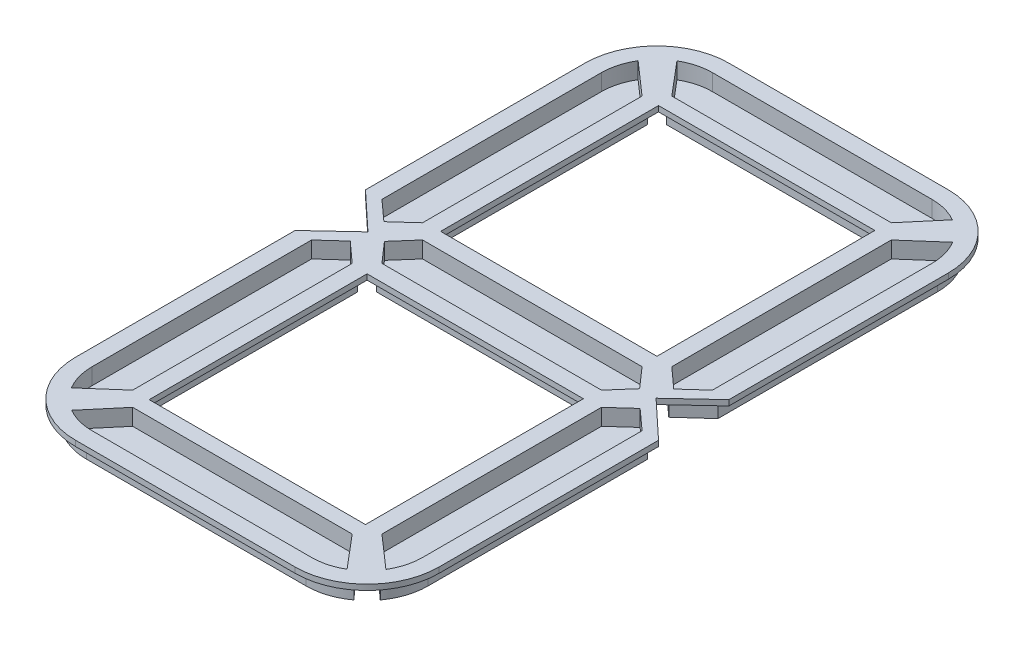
from build123d import *

# Parameters (mm, degrees)
SALIENTE_EXTRUIR1_DEPTH   = 4
SALIENTE_EXTRUIR2_DEPTH   = 1
CORTAR_EXTRUIR2_DEPTH     = 4
SALIENTE_EXTRUIR4_DEPTH   = 1
SALIENTE_EXTRUIR6_DEPTH   = 3
SALIENTE_EXTRUIR6_2_DEPTH = 3
SALIENTE_EXTRUIR6_3_DEPTH = 3
SALIENTE_EXTRUIR6_4_DEPTH = 3
SALIENTE_EXTRUIR6_5_DEPTH = 3
SALIENTE_EXTRUIR6_6_DEPTH = 3
CORTAR_EXTRUIR3_DEPTH     = 2
SALIENTE_EXTRUIR8_DEPTH   = 1


with BuildPart() as part:
    # Croquis1 → Saliente-Extruir1 (new body)
    with BuildSketch(Plane(origin=(0, 0, 0), x_dir=(1, 0, 0), z_dir=(0, 1, 0))):
        Polygon((20, -4.7), (-20, -4.7), (-24.25, 0), (-20, 4.7), (20, 4.7), (24.25, 0), align=None)
    extrude(amount=SALIENTE_EXTRUIR1_DEPTH)

    # Croquis2 → Saliente-Extruir2 (add)
    with BuildSketch(Plane(origin=(0, 4, 0), x_dir=(1, 0, 0), z_dir=(0, 1, 0))):
        Polygon((-20, 6.7), (20, 6.7), (26.25, 0), (20, -6.7), (-20, -6.7), (-26.25, 0), align=None)
    extrude(amount=-SALIENTE_EXTRUIR2_DEPTH)

    # Croquis3 → Cortar-Extruir2 (cut)
    with BuildSketch(Plane(origin=(0, 0, 0), x_dir=(-1, 0, 0), z_dir=(0, -1, 0))):
        Polygon((23.25, 0), (20, -3.7), (-20, -3.7), (-23.25, 0), (-20, 3.7), (20, 3.7), align=None)
    extrude(amount=-CORTAR_EXTRUIR2_DEPTH, mode=Mode.SUBTRACT)

    # Croquis4 → Saliente-Extruir4 (add)
    with BuildSketch(Plane(origin=(0, 0, 0), x_dir=(-1, 0, 0), z_dir=(0, -1, 0))):
        Polygon((23.25, 0), (20, -3.7), (-20, -3.7), (-23.25, 0), (-20, 3.7), (20, 3.7), align=None)
    extrude(amount=-SALIENTE_EXTRUIR4_DEPTH)



with BuildPart() as body_2:
    # Croquis5 → Saliente-Extruir6 (new body)
    with BuildSketch(Plane(origin=(0, 3, 0), x_dir=(-1, 0, 0), z_dir=(0, -1, 0))):
        with BuildLine():
            Line((-31.11, -6.41), (-31.11, -46.41))
            ThreePointArc((-31.11, -46.41), (-30.560340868, -49.861275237), (-28.965751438, -52.971051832))
            Line((-28.965751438, -52.971051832), (-26.41, -50.66))
            Line((-26.41, -50.66), (-21.71, -46.41))
            Line((-21.71, -46.41), (-21.71, -6.41))
            Line((-21.71, -6.41), (-26.41, -2.16))
            Line((-26.41, -2.16), (-31.11, -6.41))
        make_face()
    extrude(amount=SALIENTE_EXTRUIR6_DEPTH)


with BuildPart() as body_3:
    # Croquis5 → Saliente-Extruir6 2 (new body)
    with BuildSketch(Plane(origin=(0, 3, 0), x_dir=(-1, 0, 0), z_dir=(0, -1, 0))):
        with BuildLine():
            Line((20, -48.12), (-20, -48.12))
            Line((-20, -48.12), (-24.25, -52.82))
            Line((-24.25, -52.82), (-26.561051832, -55.375751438))
            ThreePointArc((-26.561051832, -55.375751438), (-23.451275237, -56.970340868), (-20, -57.52))
            Line((-20, -57.52), (20, -57.52))
            ThreePointArc((20, -57.52), (23.451275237, -56.970340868), (26.561051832, -55.375751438))
            Line((26.561051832, -55.375751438), (24.25, -52.82))
            Line((24.25, -52.82), (20, -48.12))
        make_face()
    extrude(amount=SALIENTE_EXTRUIR6_2_DEPTH)


with BuildPart() as body_4:
    # Croquis5 → Saliente-Extruir6 3 (new body)
    with BuildSketch(Plane(origin=(0, 3, 0), x_dir=(-1, 0, 0), z_dir=(0, -1, 0))):
        with BuildLine():
            Line((21.71, -6.41), (26.41, -2.16))
            Line((26.41, -2.16), (31.11, -6.41))
            Line((31.11, -6.41), (31.11, -46.41))
            ThreePointArc((31.11, -46.41), (30.560340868, -49.861275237), (28.965751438, -52.971051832))
            Line((28.965751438, -52.971051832), (26.41, -50.66))
            Line((26.41, -50.66), (21.71, -46.41))
            Line((21.71, -46.41), (21.71, -6.41))
        make_face()
    extrude(amount=SALIENTE_EXTRUIR6_3_DEPTH)


with BuildPart() as body_5:
    # Croquis5 → Saliente-Extruir6 4 (new body)
    with BuildSketch(Plane(origin=(0, 3, 0), x_dir=(-1, 0, 0), z_dir=(0, -1, 0))):
        with BuildLine():
            Line((21.71, 46.41), (26.41, 50.66))
            Line((26.41, 50.66), (28.965751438, 52.971051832))
            ThreePointArc((28.965751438, 52.971051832), (30.560340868, 49.861275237), (31.11, 46.41))
            Line((31.11, 46.41), (31.11, 6.41))
            Line((31.11, 6.41), (26.41, 2.16))
            Line((26.41, 2.16), (21.71, 6.41))
            Line((21.71, 6.41), (21.71, 46.41))
        make_face()
    extrude(amount=SALIENTE_EXTRUIR6_4_DEPTH)


with BuildPart() as body_6:
    # Croquis5 → Saliente-Extruir6 5 (new body)
    with BuildSketch(Plane(origin=(0, 3, 0), x_dir=(-1, 0, 0), z_dir=(0, -1, 0))):
        with BuildLine():
            Line((24.25, 52.82), (20, 48.12))
            Line((20, 48.12), (-20, 48.12))
            Line((-20, 48.12), (-24.25, 52.82))
            Line((-24.25, 52.82), (-26.561051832, 55.375751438))
            ThreePointArc((-26.561051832, 55.375751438), (-23.451275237, 56.970340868), (-20, 57.52))
            Line((-20, 57.52), (20, 57.52))
            ThreePointArc((20, 57.52), (23.451275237, 56.970340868), (26.561051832, 55.375751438))
            Line((26.561051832, 55.375751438), (24.25, 52.82))
        make_face()
    extrude(amount=SALIENTE_EXTRUIR6_5_DEPTH)


with BuildPart() as body_7:
    # Croquis5 → Saliente-Extruir6 6 (new body)
    with BuildSketch(Plane(origin=(0, 3, 0), x_dir=(-1, 0, 0), z_dir=(0, -1, 0))):
        with BuildLine():
            Line((-28.965751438, 52.971051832), (-26.41, 50.66))
            Line((-26.41, 50.66), (-21.71, 46.41))
            Line((-21.71, 46.41), (-21.71, 6.41))
            Line((-21.71, 6.41), (-26.41, 2.16))
            Line((-26.41, 2.16), (-31.11, 6.41))
            Line((-31.11, 6.41), (-31.11, 46.41))
            ThreePointArc((-31.11, 46.41), (-30.560340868, 49.861275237), (-28.965751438, 52.971051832))
        make_face()
    extrude(amount=SALIENTE_EXTRUIR6_6_DEPTH)


with BuildPart() as cortar_extruir3_tool:
    # Croquis7 → Cortar-Extruir3 (new body)
    with BuildSketch(Plane(origin=(0, 3, 0), x_dir=(1, 0, 0), z_dir=(0, 1, 0))):
        with BuildLine():
            Line((-19, 56.52), (-20, 56.52))
            ThreePointArc((-20, 56.52), (-22.635771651, 56.170369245), (-25.08923928, 55.145659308))
            Line((-25.08923928, 55.145659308), (-20, 49.12))
            Line((-20, 49.12), (-19, 49.12))
            Line((-19, 49.12), (19, 49.12))
            Line((19, 49.12), (20, 49.12))
            Line((20, 49.12), (25.08923928, 55.145659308))
            ThreePointArc((25.08923928, 55.145659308), (22.635771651, 56.170369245), (20, 56.52))
            Line((20, 56.52), (19, 56.52))
            Line((19, 56.52), (-19, 56.52))
        make_face()
        with BuildLine():
            Line((-28.656291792, 51.633094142), (-22.71, 46.41))
            Line((-22.71, 46.41), (-22.71, 45.41))
            Line((-22.71, 45.41), (-22.71, 7.41))
            Line((-22.71, 7.41), (-22.71, 6.41))
            Line((-22.71, 6.41), (-26.41, 3.064255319))
            Line((-26.41, 3.064255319), (-30.11, 6.41))
            Line((-30.11, 6.41), (-30.11, 7.41))
            Line((-30.11, 7.41), (-30.11, 45.41))
            Line((-30.11, 45.41), (-30.11, 46.41))
            ThreePointArc((-30.11, 46.41), (-29.739794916, 49.120810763), (-28.656291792, 51.633094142))
        make_face()
        with BuildLine():
            ThreePointArc((28.656291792, 51.633094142), (29.739794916, 49.120810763), (30.11, 46.41))
            Line((30.11, 46.41), (30.11, 45.41))
            Line((30.11, 45.41), (30.11, 7.41))
            Line((30.11, 7.41), (30.11, 6.41))
            Line((30.11, 6.41), (26.41, 3.064255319))
            Line((26.41, 3.064255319), (22.71, 6.41))
            Line((22.71, 6.41), (22.71, 7.41))
            Line((22.71, 7.41), (22.71, 45.41))
            Line((22.71, 45.41), (22.71, 46.41))
            Line((22.71, 46.41), (28.656291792, 51.633094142))
        make_face()
        with BuildLine():
            Line((28.656291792, -51.633094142), (22.71, -46.41))
            Line((22.71, -46.41), (22.71, -45.41))
            Line((22.71, -45.41), (22.71, -7.41))
            Line((22.71, -7.41), (22.71, -6.41))
            Line((22.71, -6.41), (26.41, -3.064255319))
            Line((26.41, -3.064255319), (30.11, -6.41))
            Line((30.11, -6.41), (30.11, -7.41))
            Line((30.11, -7.41), (30.11, -45.41))
            Line((30.11, -45.41), (30.11, -46.41))
            ThreePointArc((30.11, -46.41), (29.739794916, -49.120810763), (28.656291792, -51.633094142))
        make_face()
        with BuildLine():
            ThreePointArc((-28.656291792, -51.633094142), (-29.739794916, -49.120810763), (-30.11, -46.41))
            Line((-30.11, -46.41), (-30.11, -45.41))
            Line((-30.11, -45.41), (-30.11, -7.41))
            Line((-30.11, -7.41), (-30.11, -6.41))
            Line((-30.11, -6.41), (-26.41, -3.064255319))
            Line((-26.41, -3.064255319), (-22.71, -6.41))
            Line((-22.71, -6.41), (-22.71, -7.41))
            Line((-22.71, -7.41), (-22.71, -45.41))
            Line((-22.71, -45.41), (-22.71, -46.41))
            Line((-22.71, -46.41), (-28.656291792, -51.633094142))
        make_face()
        with BuildLine():
            Line((19, -56.52), (20, -56.52))
            ThreePointArc((20, -56.52), (22.635771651, -56.170369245), (25.08923928, -55.145659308))
            Line((25.08923928, -55.145659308), (20, -49.12))
            Line((20, -49.12), (19, -49.12))
            Line((19, -49.12), (-19, -49.12))
            Line((-19, -49.12), (-20, -49.12))
            Line((-20, -49.12), (-25.08923928, -55.145659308))
            ThreePointArc((-25.08923928, -55.145659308), (-22.635771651, -56.170369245), (-20, -56.52))
            Line((-20, -56.52), (-19, -56.52))
            Line((-19, -56.52), (19, -56.52))
        make_face()
    extrude(amount=-CORTAR_EXTRUIR3_DEPTH)


with BuildPart() as body_2_1:
    add(body_2.part)

    # Cortar-Extruir3: cut by cortar_extruir3_tool
    add(cortar_extruir3_tool.part, mode=Mode.SUBTRACT)


with BuildPart() as body_3_1:
    add(body_3.part)

    # Cortar-Extruir3: cut by cortar_extruir3_tool
    add(cortar_extruir3_tool.part, mode=Mode.SUBTRACT)


with BuildPart() as body_4_1:
    add(body_4.part)

    # Cortar-Extruir3: cut by cortar_extruir3_tool
    add(cortar_extruir3_tool.part, mode=Mode.SUBTRACT)


with BuildPart() as body_5_1:
    add(body_5.part)

    # Cortar-Extruir3: cut by cortar_extruir3_tool
    add(cortar_extruir3_tool.part, mode=Mode.SUBTRACT)


with BuildPart() as body_6_1:
    add(body_6.part)

    # Cortar-Extruir3: cut by cortar_extruir3_tool
    add(cortar_extruir3_tool.part, mode=Mode.SUBTRACT)


with BuildPart() as body_7_1:
    add(body_7.part)

    # Cortar-Extruir3: cut by cortar_extruir3_tool
    add(cortar_extruir3_tool.part, mode=Mode.SUBTRACT)


with BuildPart() as part_1:
    add(part.part)

    add(body_2_1.part)  # Saliente-Extruir8 merges body 2

    add(body_3_1.part)  # Saliente-Extruir8 merges body 3

    add(body_4_1.part)  # Saliente-Extruir8 merges body 4

    add(body_5_1.part)  # Saliente-Extruir8 merges body 5

    add(body_6_1.part)  # Saliente-Extruir8 merges body 6

    add(body_7_1.part)  # Saliente-Extruir8 merges body 7
    # Croquis8 → Saliente-Extruir8 (add)
    # profile 1 of 3: a face of its own
    with BuildSketch(Plane(origin=(0, 3, 0), x_dir=(1, 0, 0), z_dir=(0, 1, 0))):
        with BuildLine():
            Line((-20, -59.52), (20, -59.52))
            ThreePointArc((20, -59.52), (29.270169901, -55.680169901), (33.11, -46.41))
            Line((33.11, -46.41), (33.11, -6.41))
            Line((33.11, -6.41), (26.25, 0))
            Line((26.25, 0), (19.71, -6.41))
            Line((19.71, -6.41), (19.71, -46.41))
            Line((19.71, -46.41), (-19.71, -46.41))
            Line((-19.71, -46.41), (-19.71, -6.41))
            Line((-19.71, -6.41), (-26.25, 0))
            Line((-26.25, 0), (-33.11, -6.41))
            Line((-33.11, -6.41), (-33.11, -46.41))
            ThreePointArc((-33.11, -46.41), (-29.270169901, -55.680169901), (-20, -59.52))
        make_face()
        with BuildLine():
            Line((-20, -56.52), (20, -56.52))
            ThreePointArc((20, -56.52), (22.635771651, -56.170369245), (25.08923928, -55.145659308))
            Line((25.08923928, -55.145659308), (20, -49.12))
            Line((20, -49.12), (-20, -49.12))
            Line((-20, -49.12), (-25.08923928, -55.145659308))
            ThreePointArc((-25.08923928, -55.145659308), (-22.635771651, -56.170369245), (-20, -56.52))
        make_face(mode=Mode.SUBTRACT)
        with BuildLine():
            Line((-22.71, -46.41), (-28.656291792, -51.633094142))
            ThreePointArc((-28.656291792, -51.633094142), (-29.739794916, -49.120810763), (-30.11, -46.41))
            Line((-30.11, -46.41), (-30.11, -6.41))
            Line((-30.11, -6.41), (-26.41, -3.064255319))
            Line((-26.41, -3.064255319), (-22.71, -6.41))
            Line((-22.71, -6.41), (-22.71, -46.41))
        make_face(mode=Mode.SUBTRACT)
        with BuildLine():
            ThreePointArc((28.965751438, -52.971051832), (30.560340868, -49.861275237), (31.11, -46.41))
            Line((31.11, -46.41), (31.11, -6.41))
            Line((31.11, -6.41), (26.41, -2.16))
            Line((26.41, -2.16), (21.71, -6.41))
            Line((21.71, -6.41), (21.71, -46.41))
            Line((21.71, -46.41), (28.965751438, -52.971051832))
        make_face(mode=Mode.SUBTRACT)
    # profile 2 of 3: a face of its own
    with BuildSketch(Plane(origin=(0, 3, 0), x_dir=(1, 0, 0), z_dir=(0, 1, 0))):
        with BuildLine():
            Line((21.71, -46.41), (28.965751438, -52.971051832))
            ThreePointArc((28.965751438, -52.971051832), (30.560340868, -49.861275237), (31.11, -46.41))
            Line((31.11, -46.41), (31.11, -6.41))
            Line((31.11, -6.41), (26.41, -2.16))
            Line((26.41, -2.16), (21.71, -6.41))
            Line((21.71, -6.41), (21.71, -46.41))
        make_face()
        with BuildLine():
            Line((30.11, -6.41), (30.11, -46.41))
            ThreePointArc((30.11, -46.41), (29.739794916, -49.120810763), (28.656291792, -51.633094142))
            Line((28.656291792, -51.633094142), (22.71, -46.41))
            Line((22.71, -46.41), (22.71, -6.41))
            Line((22.71, -6.41), (26.41, -3.064255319))
            Line((26.41, -3.064255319), (30.11, -6.41))
        make_face(mode=Mode.SUBTRACT)
    # profile 3 of 3: a face of its own
    with BuildSketch(Plane(origin=(0, 3, 0), x_dir=(1, 0, 0), z_dir=(0, 1, 0))):
        with BuildLine():
            Line((-20, 59.52), (20, 59.52))
            ThreePointArc((20, 59.52), (29.270169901, 55.680169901), (33.11, 46.41))
            Line((33.11, 46.41), (33.11, 6.41))
            Line((33.11, 6.41), (26.25, 0))
            Line((26.25, 0), (19.71, 6.41))
            Line((19.71, 6.41), (19.71, 46.41))
            Line((19.71, 46.41), (-19.71, 46.41))
            Line((-19.71, 46.41), (-19.71, 6.41))
            Line((-19.71, 6.41), (-26.25, 0))
            Line((-26.25, 0), (-33.11, 6.41))
            Line((-33.11, 6.41), (-33.11, 46.41))
            ThreePointArc((-33.11, 46.41), (-29.270169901, 55.680169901), (-20, 59.52))
        make_face()
        with BuildLine():
            ThreePointArc((-20, 56.52), (-22.635771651, 56.170369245), (-25.08923928, 55.145659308))
            Line((-25.08923928, 55.145659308), (-20, 49.12))
            Line((-20, 49.12), (20, 49.12))
            Line((20, 49.12), (25.08923928, 55.145659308))
            ThreePointArc((25.08923928, 55.145659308), (22.635771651, 56.170369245), (20, 56.52))
            Line((20, 56.52), (-20, 56.52))
        make_face(mode=Mode.SUBTRACT)
        with BuildLine():
            ThreePointArc((-28.656291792, 51.633094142), (-29.739794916, 49.120810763), (-30.11, 46.41))
            Line((-30.11, 46.41), (-30.11, 6.41))
            Line((-30.11, 6.41), (-26.41, 3.064255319))
            Line((-26.41, 3.064255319), (-22.71, 6.41))
            Line((-22.71, 6.41), (-22.71, 46.41))
            Line((-22.71, 46.41), (-28.656291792, 51.633094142))
        make_face(mode=Mode.SUBTRACT)
        with BuildLine():
            Line((22.71, 46.41), (28.656291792, 51.633094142))
            ThreePointArc((28.656291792, 51.633094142), (29.739794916, 49.120810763), (30.11, 46.41))
            Line((30.11, 46.41), (30.11, 6.41))
            Line((30.11, 6.41), (26.41, 3.064255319))
            Line((26.41, 3.064255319), (22.71, 6.41))
            Line((22.71, 6.41), (22.71, 46.41))
        make_face(mode=Mode.SUBTRACT)
    extrude(amount=SALIENTE_EXTRUIR8_DEPTH)


solid = part_1.part
